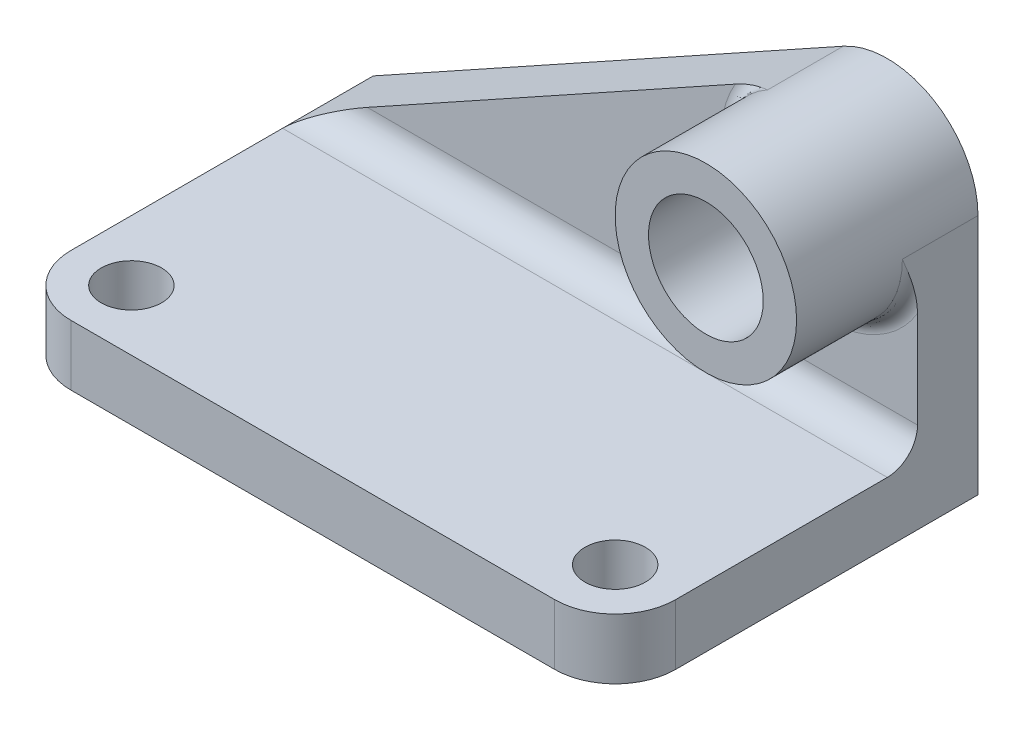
ISO-10303-21;
HEADER;
FILE_DESCRIPTION(('STEP AP214'),'2;1');
FILE_NAME('part.step','',(''),(''),'','','');
FILE_SCHEMA(('AUTOMOTIVE_DESIGN { 1 0 10303 214 1 1 1 1 }'));
ENDSEC;
DATA;
#1=APPLICATION_CONTEXT('core data for automotive mechanical design processes');
#2=APPLICATION_PROTOCOL_DEFINITION('international standard','automotive_design',2000,#1);
#3=PRODUCT_CONTEXT('',#1,'mechanical');
#4=PRODUCT('Part','Part','',(#3));
#5=PRODUCT_RELATED_PRODUCT_CATEGORY('part','',(#4));
#6=PRODUCT_DEFINITION_FORMATION('','',#4);
#7=PRODUCT_DEFINITION_CONTEXT('part definition',#1,'design');
#8=PRODUCT_DEFINITION('design','',#6,#7);
#9=PRODUCT_DEFINITION_SHAPE('','',#8);
#10=(LENGTH_UNIT() NAMED_UNIT(*) SI_UNIT(.MILLI.,.METRE.));
#11=(NAMED_UNIT(*) PLANE_ANGLE_UNIT() SI_UNIT($,.RADIAN.));
#12=(NAMED_UNIT(*) SI_UNIT($,.STERADIAN.) SOLID_ANGLE_UNIT());
#13=UNCERTAINTY_MEASURE_WITH_UNIT(LENGTH_MEASURE(1.E-05),#10,'distance_accuracy_value','');
#14=(GEOMETRIC_REPRESENTATION_CONTEXT(3) GLOBAL_UNCERTAINTY_ASSIGNED_CONTEXT((#13)) GLOBAL_UNIT_ASSIGNED_CONTEXT((#10,
#11,#12)) REPRESENTATION_CONTEXT('',''));
#15=CARTESIAN_POINT('',(0.,0.,0.));
#16=DIRECTION('',(0.,0.,1.));
#17=DIRECTION('',(1.,0.,0.));
#18=AXIS2_PLACEMENT_3D('',#15,#16,#17);
#19=CARTESIAN_POINT('',(-19.05,50.8,12.7));
#20=DIRECTION('',(0.,0.,1.));
#21=DIRECTION('',(1.,0.,0.));
#22=AXIS2_PLACEMENT_3D('',#19,#20,#21);
#23=PLANE('',#22);
#24=DIRECTION('',(0.874457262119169,0.485102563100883,0.));
#25=VECTOR('',#24,1.);
#26=CARTESIAN_POINT('',(-28.2912038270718,67.4584108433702,12.7));
#27=LINE('',#26,#25);
#28=CARTESIAN_POINT('',(-115.553341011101,19.05,12.7));
#29=VERTEX_POINT('',#28);
#30=CARTESIAN_POINT('',(-38.3016629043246,61.9051384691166,12.7));
#31=VERTEX_POINT('',#30);
#32=EDGE_CURVE('E131',#29,#31,#27,.T.);
#33=ORIENTED_EDGE('',*,*,#32,.F.);
#34=DIRECTION('',(-1.,0.,0.));
#35=VECTOR('',#34,1.);
#36=CARTESIAN_POINT('',(-19.05,19.05,12.7));
#37=LINE('',#36,#35);
#38=CARTESIAN_POINT('',(0.,19.05,12.7));
#39=VERTEX_POINT('',#38);
#40=EDGE_CURVE('E226',#29,#39,#37,.F.);
#41=ORIENTED_EDGE('',*,*,#40,.T.);
#42=DIRECTION('',(0.,-1.,0.));
#43=VECTOR('',#42,1.);
#44=CARTESIAN_POINT('',(0.,12.7,12.7));
#45=LINE('',#44,#43);
#46=CARTESIAN_POINT('',(0.,39.3523747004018,12.7));
#47=VERTEX_POINT('',#46);
#48=EDGE_CURVE('E138',#47,#39,#45,.T.);
#49=ORIENTED_EDGE('',*,*,#48,.F.);
#50=CARTESIAN_POINT('',(-19.05,50.8,12.7));
#51=DIRECTION('',(0.,0.,1.));
#52=DIRECTION('',(1.,0.,0.));
#53=AXIS2_PLACEMENT_3D('',#50,#51,#52);
#54=CIRCLE('',#53,22.225);
#55=EDGE_CURVE('E173',#47,#31,#54,.F.);
#56=ORIENTED_EDGE('',*,*,#55,.T.);
#57=EDGE_LOOP('',(#33,#41,#49,#56));
#58=FACE_BOUND('',#57,.T.);
#59=ADVANCED_FACE('F33',(#58),#23,.T.);
#60=CARTESIAN_POINT('',(0.,12.7,0.));
#61=DIRECTION('',(-1.,0.,0.));
#62=DIRECTION('',(0.,0.,1.));
#63=AXIS2_PLACEMENT_3D('',#60,#61,#62);
#64=PLANE('',#63);
#65=DIRECTION('',(0.,0.,-1.));
#66=VECTOR('',#65,1.);
#67=CARTESIAN_POINT('',(0.,12.7,0.));
#68=LINE('',#67,#66);
#69=CARTESIAN_POINT('',(0.,12.7,63.5));
#70=VERTEX_POINT('',#69);
#71=CARTESIAN_POINT('',(0.,12.7,19.05));
#72=VERTEX_POINT('',#71);
#73=EDGE_CURVE('E155',#70,#72,#68,.T.);
#74=ORIENTED_EDGE('',*,*,#73,.F.);
#75=DIRECTION('',(0.,-1.,0.));
#76=VECTOR('',#75,1.);
#77=CARTESIAN_POINT('',(0.,12.7,63.5));
#78=LINE('',#77,#76);
#79=CARTESIAN_POINT('',(0.,0.,63.5));
#80=VERTEX_POINT('',#79);
#81=EDGE_CURVE('E171',#70,#80,#78,.T.);
#82=ORIENTED_EDGE('',*,*,#81,.T.);
#83=DIRECTION('',(0.,0.,-1.));
#84=VECTOR('',#83,1.);
#85=CARTESIAN_POINT('',(0.,0.,0.));
#86=LINE('',#85,#84);
#87=CARTESIAN_POINT('',(0.,0.,0.));
#88=VERTEX_POINT('',#87);
#89=EDGE_CURVE('E114',#80,#88,#86,.T.);
#90=ORIENTED_EDGE('',*,*,#89,.T.);
#91=DIRECTION('',(0.,-1.,0.));
#92=VECTOR('',#91,1.);
#93=CARTESIAN_POINT('',(0.,12.7,0.));
#94=LINE('',#93,#92);
#95=CARTESIAN_POINT('',(0.,50.8,0.));
#96=VERTEX_POINT('',#95);
#97=EDGE_CURVE('E107',#96,#88,#94,.T.);
#98=ORIENTED_EDGE('',*,*,#97,.F.);
#99=DIRECTION('',(0.,0.,-1.));
#100=VECTOR('',#99,1.);
#101=CARTESIAN_POINT('',(0.,50.8,12.7));
#102=LINE('',#101,#100);
#103=CARTESIAN_POINT('',(0.,50.8,15.875));
#104=VERTEX_POINT('',#103);
#105=EDGE_CURVE('E110',#104,#96,#102,.T.);
#106=ORIENTED_EDGE('',*,*,#105,.F.);
#107=CARTESIAN_POINT('',(0.,39.3523747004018,12.7));
#108=CARTESIAN_POINT('',(0.,39.5751778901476,12.7000367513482));
#109=CARTESIAN_POINT('',(0.,39.7979071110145,12.7062199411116));
#110=CARTESIAN_POINT('',(0.,40.242669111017,12.729552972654));
#111=CARTESIAN_POINT('',(0.,40.4647022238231,12.7466963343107));
#112=CARTESIAN_POINT('',(0.,40.907180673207,12.790566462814));
#113=CARTESIAN_POINT('',(0.,41.1276286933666,12.8172668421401));
#114=CARTESIAN_POINT('',(0.,41.5673473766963,12.8791779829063));
#115=CARTESIAN_POINT('',(0.,41.7866178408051,12.9143901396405));
#116=CARTESIAN_POINT('',(0.,42.4381432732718,13.03055146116));
#117=CARTESIAN_POINT('',(0.,42.8684521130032,13.1224961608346));
#118=CARTESIAN_POINT('',(0.,43.7236529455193,13.3296034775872));
#119=CARTESIAN_POINT('',(0.,44.1485403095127,13.4447846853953));
#120=CARTESIAN_POINT('',(0.,45.0991803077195,13.7243947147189));
#121=CARTESIAN_POINT('',(0.,45.6234199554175,13.8939234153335));
#122=CARTESIAN_POINT('',(0.,46.6651114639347,14.2527994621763));
#123=CARTESIAN_POINT('',(0.,47.1825613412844,14.4421524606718));
#124=CARTESIAN_POINT('',(0.,48.729771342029,15.0298892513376));
#125=CARTESIAN_POINT('',(0.,49.7522109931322,15.4472423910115));
#126=CARTESIAN_POINT('',(0.,50.7829622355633,15.8680443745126));
#127=CARTESIAN_POINT('',(0.,50.7914811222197,15.8715221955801));
#128=CARTESIAN_POINT('',(0.,50.8,15.875));
#129=B_SPLINE_CURVE_WITH_KNOTS('',3,(#107,#108,#109,#110,#111,#112,#113,#114,#115,#116,#117,
#118,#119,#120,#121,#122,#123,#124,#125,#126,#127,#128),.UNSPECIFIED.,.F.,.F.,(4,2,2,2,2,2,2,2,
2,2,4),(0.,0.668218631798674,1.33604254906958,2.00203660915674,2.66813991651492,
3.98728120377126,5.30748210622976,6.95977810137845,8.61254648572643,11.9249522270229,
11.9525565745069),.UNSPECIFIED.);
#130=EDGE_CURVE('E218',#104,#47,#129,.F.);
#131=ORIENTED_EDGE('',*,*,#130,.T.);
#132=ORIENTED_EDGE('',*,*,#48,.T.);
#133=CARTESIAN_POINT('',(0.,19.05,19.05));
#134=DIRECTION('',(-1.,0.,0.));
#135=DIRECTION('',(0.,0.,1.));
#136=AXIS2_PLACEMENT_3D('',#133,#134,#135);
#137=CIRCLE('',#136,6.35);
#138=EDGE_CURVE('E11',#39,#72,#137,.T.);
#139=ORIENTED_EDGE('',*,*,#138,.T.);
#140=EDGE_LOOP('',(#74,#82,#90,#98,#106,#131,#132,#139));
#141=FACE_BOUND('',#140,.T.);
#142=ADVANCED_FACE('F35',(#141),#64,.F.);
#143=CARTESIAN_POINT('',(0.,12.7,0.));
#144=DIRECTION('',(0.,0.,1.));
#145=DIRECTION('',(1.,0.,0.));
#146=AXIS2_PLACEMENT_3D('',#143,#144,#145);
#147=PLANE('',#146);
#148=CARTESIAN_POINT('',(-19.05,50.8,0.));
#149=DIRECTION('',(0.,0.,1.));
#150=DIRECTION('',(1.,0.,0.));
#151=AXIS2_PLACEMENT_3D('',#148,#149,#150);
#152=CIRCLE('',#151,12.0489236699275);
#153=CARTESIAN_POINT('',(-7.00107633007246,50.8,0.));
#154=VERTEX_POINT('',#153);
#155=EDGE_CURVE('E406',#154,#154,#152,.T.);
#156=ORIENTED_EDGE('',*,*,#155,.T.);
#157=EDGE_LOOP('',(#156));
#158=FACE_BOUND('',#157,.T.);
#159=DIRECTION('',(-1.,0.,0.));
#160=VECTOR('',#159,1.);
#161=CARTESIAN_POINT('',(0.,0.,0.));
#162=LINE('',#161,#160);
#163=CARTESIAN_POINT('',(-127.,0.,0.));
#164=VERTEX_POINT('',#163);
#165=EDGE_CURVE('E147',#88,#164,#162,.T.);
#166=ORIENTED_EDGE('',*,*,#165,.T.);
#167=DIRECTION('',(0.,-1.,0.));
#168=VECTOR('',#167,1.);
#169=CARTESIAN_POINT('',(-127.,12.7,0.));
#170=LINE('',#169,#168);
#171=CARTESIAN_POINT('',(-127.,12.7,0.));
#172=VERTEX_POINT('',#171);
#173=EDGE_CURVE('E119',#172,#164,#170,.T.);
#174=ORIENTED_EDGE('',*,*,#173,.F.);
#175=DIRECTION('',(0.874457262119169,0.485102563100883,0.));
#176=VECTOR('',#175,1.);
#177=CARTESIAN_POINT('',(-28.2912038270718,67.4584108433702,0.));
#178=LINE('',#177,#176);
#179=CARTESIAN_POINT('',(-28.2912038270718,67.4584108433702,0.));
#180=VERTEX_POINT('',#179);
#181=EDGE_CURVE('E135',#172,#180,#178,.T.);
#182=ORIENTED_EDGE('',*,*,#181,.T.);
#183=CARTESIAN_POINT('',(-19.05,50.8,0.));
#184=DIRECTION('',(0.,0.,-1.));
#185=DIRECTION('',(1.,0.,0.));
#186=AXIS2_PLACEMENT_3D('',#183,#184,#185);
#187=CIRCLE('',#186,19.05);
#188=EDGE_CURVE('E125',#180,#96,#187,.T.);
#189=ORIENTED_EDGE('',*,*,#188,.T.);
#190=ORIENTED_EDGE('',*,*,#97,.T.);
#191=EDGE_LOOP('',(#166,#174,#182,#189,#190));
#192=FACE_BOUND('',#191,.T.);
#193=ADVANCED_FACE('F133',(#158,#192),#147,.F.);
#194=CARTESIAN_POINT('',(-127.,12.7,0.));
#195=DIRECTION('',(1.,0.,0.));
#196=DIRECTION('',(0.,0.,-1.));
#197=AXIS2_PLACEMENT_3D('',#194,#195,#196);
#198=PLANE('',#197);
#199=DIRECTION('',(0.,0.,1.));
#200=VECTOR('',#199,1.);
#201=CARTESIAN_POINT('',(-127.,0.,0.));
#202=LINE('',#201,#200);
#203=CARTESIAN_POINT('',(-127.,0.,63.5));
#204=VERTEX_POINT('',#203);
#205=EDGE_CURVE('E149',#164,#204,#202,.T.);
#206=ORIENTED_EDGE('',*,*,#205,.T.);
#207=DIRECTION('',(0.,-1.,0.));
#208=VECTOR('',#207,1.);
#209=CARTESIAN_POINT('',(-127.,12.7,63.5));
#210=LINE('',#209,#208);
#211=CARTESIAN_POINT('',(-127.,12.7,63.5));
#212=VERTEX_POINT('',#211);
#213=EDGE_CURVE('E165',#204,#212,#210,.F.);
#214=ORIENTED_EDGE('',*,*,#213,.T.);
#215=DIRECTION('',(0.,0.,1.));
#216=VECTOR('',#215,1.);
#217=CARTESIAN_POINT('',(-127.,12.7,0.));
#218=LINE('',#217,#216);
#219=CARTESIAN_POINT('',(-127.,12.7,19.05));
#220=VERTEX_POINT('',#219);
#221=EDGE_CURVE('E164',#220,#212,#218,.T.);
#222=ORIENTED_EDGE('',*,*,#221,.F.);
#223=EDGE_CURVE('E213',#172,#220,#218,.T.);
#224=ORIENTED_EDGE('',*,*,#223,.F.);
#225=ORIENTED_EDGE('',*,*,#173,.T.);
#226=EDGE_LOOP('',(#206,#214,#222,#224,#225));
#227=FACE_BOUND('',#226,.T.);
#228=ADVANCED_FACE('F197',(#227),#198,.F.);
#229=CARTESIAN_POINT('',(0.,12.7,76.2));
#230=DIRECTION('',(0.,0.,-1.));
#231=DIRECTION('',(-1.,0.,0.));
#232=AXIS2_PLACEMENT_3D('',#229,#230,#231);
#233=PLANE('',#232);
#234=DIRECTION('',(1.,0.,0.));
#235=VECTOR('',#234,1.);
#236=CARTESIAN_POINT('',(0.,12.7,76.2));
#237=LINE('',#236,#235);
#238=CARTESIAN_POINT('',(-114.3,12.7,76.2));
#239=VERTEX_POINT('',#238);
#240=CARTESIAN_POINT('',(-12.7,12.7,76.2));
#241=VERTEX_POINT('',#240);
#242=EDGE_CURVE('E207',#239,#241,#237,.T.);
#243=ORIENTED_EDGE('',*,*,#242,.F.);
#244=DIRECTION('',(0.,-1.,0.));
#245=VECTOR('',#244,1.);
#246=CARTESIAN_POINT('',(-114.3,12.7,76.2));
#247=LINE('',#246,#245);
#248=CARTESIAN_POINT('',(-114.3,0.,76.2));
#249=VERTEX_POINT('',#248);
#250=EDGE_CURVE('E184',#239,#249,#247,.T.);
#251=ORIENTED_EDGE('',*,*,#250,.T.);
#252=DIRECTION('',(1.,0.,0.));
#253=VECTOR('',#252,1.);
#254=CARTESIAN_POINT('',(0.,0.,76.2));
#255=LINE('',#254,#253);
#256=CARTESIAN_POINT('',(-12.7,0.,76.2));
#257=VERTEX_POINT('',#256);
#258=EDGE_CURVE('E152',#249,#257,#255,.T.);
#259=ORIENTED_EDGE('',*,*,#258,.T.);
#260=DIRECTION('',(0.,-1.,0.));
#261=VECTOR('',#260,1.);
#262=CARTESIAN_POINT('',(-12.7,12.7,76.2));
#263=LINE('',#262,#261);
#264=EDGE_CURVE('E118',#257,#241,#263,.F.);
#265=ORIENTED_EDGE('',*,*,#264,.T.);
#266=EDGE_LOOP('',(#243,#251,#259,#265));
#267=FACE_BOUND('',#266,.T.);
#268=ADVANCED_FACE('F211',(#267),#233,.F.);
#269=CARTESIAN_POINT('',(0.,12.7,0.));
#270=DIRECTION('',(0.,-1.,0.));
#271=DIRECTION('',(0.,0.,-1.));
#272=AXIS2_PLACEMENT_3D('',#269,#270,#271);
#273=PLANE('',#272);
#274=CARTESIAN_POINT('',(-114.3,12.7,63.5));
#275=DIRECTION('',(0.,1.,0.));
#276=DIRECTION('',(0.,0.,-1.));
#277=AXIS2_PLACEMENT_3D('',#274,#275,#276);
#278=CIRCLE('',#277,6.34999999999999);
#279=CARTESIAN_POINT('',(-114.3,12.7,57.15));
#280=VERTEX_POINT('',#279);
#281=EDGE_CURVE('E411',#280,#280,#278,.T.);
#282=ORIENTED_EDGE('',*,*,#281,.F.);
#283=EDGE_LOOP('',(#282));
#284=FACE_BOUND('',#283,.T.);
#285=CARTESIAN_POINT('',(-12.7,12.7,63.5));
#286=DIRECTION('',(0.,1.,0.));
#287=DIRECTION('',(0.,0.,1.));
#288=AXIS2_PLACEMENT_3D('',#285,#286,#287);
#289=CIRCLE('',#288,6.35);
#290=CARTESIAN_POINT('',(-12.7,12.7,69.85));
#291=VERTEX_POINT('',#290);
#292=EDGE_CURVE('E418',#291,#291,#289,.T.);
#293=ORIENTED_EDGE('',*,*,#292,.F.);
#294=EDGE_LOOP('',(#293));
#295=FACE_BOUND('',#294,.T.);
#296=ORIENTED_EDGE('',*,*,#73,.T.);
#297=DIRECTION('',(-1.,0.,0.));
#298=VECTOR('',#297,1.);
#299=CARTESIAN_POINT('',(0.,12.7,19.05));
#300=LINE('',#299,#298);
#301=EDGE_CURVE('E224',#72,#220,#300,.T.);
#302=ORIENTED_EDGE('',*,*,#301,.T.);
#303=ORIENTED_EDGE('',*,*,#221,.T.);
#304=CARTESIAN_POINT('',(-114.3,12.7,63.5));
#305=DIRECTION('',(0.,-1.,0.));
#306=DIRECTION('',(0.,0.,-1.));
#307=AXIS2_PLACEMENT_3D('',#304,#305,#306);
#308=CIRCLE('',#307,12.7);
#309=EDGE_CURVE('E169',#212,#239,#308,.F.);
#310=ORIENTED_EDGE('',*,*,#309,.T.);
#311=ORIENTED_EDGE('',*,*,#242,.T.);
#312=CARTESIAN_POINT('',(-12.7,12.7,63.5));
#313=DIRECTION('',(0.,-1.,0.));
#314=DIRECTION('',(0.,0.,-1.));
#315=AXIS2_PLACEMENT_3D('',#312,#313,#314);
#316=CIRCLE('',#315,12.7);
#317=EDGE_CURVE('E167',#241,#70,#316,.F.);
#318=ORIENTED_EDGE('',*,*,#317,.T.);
#319=EDGE_LOOP('',(#296,#302,#303,#310,#311,#318));
#320=FACE_BOUND('',#319,.T.);
#321=ADVANCED_FACE('F206',(#284,#295,#320),#273,.F.);
#322=CARTESIAN_POINT('',(0.,0.,0.));
#323=DIRECTION('',(0.,-1.,0.));
#324=DIRECTION('',(0.,0.,-1.));
#325=AXIS2_PLACEMENT_3D('',#322,#323,#324);
#326=PLANE('',#325);
#327=CARTESIAN_POINT('',(-114.3,0.,63.5));
#328=DIRECTION('',(0.,1.,0.));
#329=DIRECTION('',(0.,0.,-1.));
#330=AXIS2_PLACEMENT_3D('',#327,#328,#329);
#331=CIRCLE('',#330,6.34999999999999);
#332=CARTESIAN_POINT('',(-114.3,0.,57.15));
#333=VERTEX_POINT('',#332);
#334=EDGE_CURVE('E416',#333,#333,#331,.T.);
#335=ORIENTED_EDGE('',*,*,#334,.T.);
#336=EDGE_LOOP('',(#335));
#337=FACE_BOUND('',#336,.T.);
#338=CARTESIAN_POINT('',(-12.7,0.,63.5));
#339=DIRECTION('',(0.,1.,0.));
#340=DIRECTION('',(0.,0.,1.));
#341=AXIS2_PLACEMENT_3D('',#338,#339,#340);
#342=CIRCLE('',#341,6.35);
#343=CARTESIAN_POINT('',(-12.7,0.,69.85));
#344=VERTEX_POINT('',#343);
#345=EDGE_CURVE('E141',#344,#344,#342,.T.);
#346=ORIENTED_EDGE('',*,*,#345,.T.);
#347=EDGE_LOOP('',(#346));
#348=FACE_BOUND('',#347,.T.);
#349=ORIENTED_EDGE('',*,*,#258,.F.);
#350=CARTESIAN_POINT('',(-114.3,0.,63.5));
#351=DIRECTION('',(0.,-1.,0.));
#352=DIRECTION('',(0.,0.,-1.));
#353=AXIS2_PLACEMENT_3D('',#350,#351,#352);
#354=CIRCLE('',#353,12.7);
#355=EDGE_CURVE('E188',#249,#204,#354,.T.);
#356=ORIENTED_EDGE('',*,*,#355,.T.);
#357=ORIENTED_EDGE('',*,*,#205,.F.);
#358=ORIENTED_EDGE('',*,*,#165,.F.);
#359=ORIENTED_EDGE('',*,*,#89,.F.);
#360=CARTESIAN_POINT('',(-12.7,0.,63.5));
#361=DIRECTION('',(0.,-1.,0.));
#362=DIRECTION('',(0.,0.,-1.));
#363=AXIS2_PLACEMENT_3D('',#360,#361,#362);
#364=CIRCLE('',#363,12.7);
#365=EDGE_CURVE('E187',#80,#257,#364,.T.);
#366=ORIENTED_EDGE('',*,*,#365,.T.);
#367=EDGE_LOOP('',(#349,#356,#357,#358,#359,#366));
#368=FACE_BOUND('',#367,.T.);
#369=ADVANCED_FACE('F240',(#337,#348,#368),#326,.T.);
#370=CARTESIAN_POINT('',(-19.05,50.8,12.7));
#371=DIRECTION('',(0.,0.,-1.));
#372=DIRECTION('',(-1.,0.,0.));
#373=AXIS2_PLACEMENT_3D('',#370,#371,#372);
#374=CYLINDRICAL_SURFACE('',#373,19.05);
#375=DIRECTION('',(0.,0.,-1.));
#376=VECTOR('',#375,1.);
#377=CARTESIAN_POINT('',(-28.2912038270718,67.4584108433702,12.7));
#378=LINE('',#377,#376);
#379=CARTESIAN_POINT('',(-28.2912038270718,67.4584108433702,15.875));
#380=VERTEX_POINT('',#379);
#381=EDGE_CURVE('E130',#380,#180,#378,.T.);
#382=ORIENTED_EDGE('',*,*,#381,.F.);
#383=CARTESIAN_POINT('',(-19.05,50.8,15.875));
#384=DIRECTION('',(0.,0.,1.));
#385=DIRECTION('',(1.,0.,0.));
#386=AXIS2_PLACEMENT_3D('',#383,#384,#385);
#387=CIRCLE('',#386,19.05);
#388=EDGE_CURVE('E128',#380,#104,#387,.T.);
#389=ORIENTED_EDGE('',*,*,#388,.T.);
#390=ORIENTED_EDGE('',*,*,#105,.T.);
#391=ORIENTED_EDGE('',*,*,#188,.F.);
#392=EDGE_LOOP('',(#382,#389,#390,#391));
#393=FACE_BOUND('',#392,.T.);
#394=CARTESIAN_POINT('',(-19.05,50.8,38.1));
#395=DIRECTION('',(0.,0.,1.));
#396=DIRECTION('',(1.,0.,0.));
#397=AXIS2_PLACEMENT_3D('',#394,#395,#396);
#398=CIRCLE('',#397,19.05);
#399=CARTESIAN_POINT('',(0.,50.8,38.1));
#400=VERTEX_POINT('',#399);
#401=EDGE_CURVE('E136',#400,#400,#398,.T.);
#402=ORIENTED_EDGE('',*,*,#401,.F.);
#403=EDGE_LOOP('',(#402));
#404=FACE_BOUND('',#403,.T.);
#405=ADVANCED_FACE('F123',(#393,#404),#374,.T.);
#406=CARTESIAN_POINT('',(-28.2912038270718,67.4584108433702,12.7));
#407=DIRECTION('',(-0.485102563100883,0.874457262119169,0.));
#408=DIRECTION('',(-0.874457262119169,-0.485102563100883,0.));
#409=AXIS2_PLACEMENT_3D('',#406,#407,#408);
#410=PLANE('',#409);
#411=ORIENTED_EDGE('',*,*,#181,.F.);
#412=ORIENTED_EDGE('',*,*,#223,.T.);
#413=CARTESIAN_POINT('',(-115.553341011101,19.05,19.05));
#414=DIRECTION('',(-0.485102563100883,0.874457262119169,0.));
#415=DIRECTION('',(-0.874457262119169,-0.485102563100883,0.));
#416=AXIS2_PLACEMENT_3D('',#413,#414,#415);
#417=ELLIPSE('',#416,13.0900153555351,6.35);
#418=EDGE_CURVE('E43',#220,#29,#417,.F.);
#419=ORIENTED_EDGE('',*,*,#418,.T.);
#420=ORIENTED_EDGE('',*,*,#32,.T.);
#421=CARTESIAN_POINT('',(-38.3016629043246,61.9051384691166,12.7));
#422=CARTESIAN_POINT('',(-38.1068310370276,62.0132208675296,12.7000367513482));
#423=CARTESIAN_POINT('',(-37.912063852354,62.1212673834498,12.7062199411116));
#424=CARTESIAN_POINT('',(-37.5231384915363,62.3370225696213,12.7295529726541));
#425=CARTESIAN_POINT('',(-37.3289800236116,62.4447314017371,12.7466963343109));
#426=CARTESIAN_POINT('',(-36.942051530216,62.6593788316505,12.7905664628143));
#427=CARTESIAN_POINT('',(-36.7492791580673,62.7663187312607,12.8172668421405));
#428=CARTESIAN_POINT('',(-36.3647639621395,62.9796273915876,12.879177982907));
#429=CARTESIAN_POINT('',(-36.173021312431,63.0859960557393,12.9143901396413));
#430=CARTESIAN_POINT('',(-35.6032901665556,63.402052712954,13.0305514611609));
#431=CARTESIAN_POINT('',(-35.2270034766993,63.6107966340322,13.1224961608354));
#432=CARTESIAN_POINT('',(-34.4791668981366,64.025656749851,13.3296034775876));
#433=CARTESIAN_POINT('',(-34.1076210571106,64.231770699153,13.4447846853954));
#434=CARTESIAN_POINT('',(-33.2763270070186,64.6929285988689,13.7243947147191));
#435=CARTESIAN_POINT('',(-32.8179018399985,64.9472385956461,13.8939234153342));
#436=CARTESIAN_POINT('',(-31.9069871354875,65.4525658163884,14.2527994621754));
#437=CARTESIAN_POINT('',(-31.4544993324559,65.7035820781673,14.4421524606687));
#438=CARTESIAN_POINT('',(-30.1015303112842,66.4541376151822,15.0298892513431));
#439=CARTESIAN_POINT('',(-29.2074505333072,66.9501257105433,15.4472423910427));
#440=CARTESIAN_POINT('',(-28.3061026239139,67.4501457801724,15.8680443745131));
#441=CARTESIAN_POINT('',(-28.2986532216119,67.4542783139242,15.8715221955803));
#442=CARTESIAN_POINT('',(-28.2912038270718,67.4584108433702,15.875));
#443=B_SPLINE_CURVE_WITH_KNOTS('',3,(#421,#422,#423,#424,#425,#426,#427,#428,#429,#430,#431,
#432,#433,#434,#435,#436,#437,#438,#439,#440,#441,#442),.UNSPECIFIED.,.F.,.F.,(4,2,2,2,2,2,2,2,
2,2,4),(0.,0.668218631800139,1.3360425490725,2.00203660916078,2.66813991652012,3.98728120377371,
5.30748210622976,6.95977810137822,8.61254648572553,11.9249522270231,11.9525565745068),.UNSPECIFIED.);
#444=EDGE_CURVE('E264',#31,#380,#443,.T.);
#445=ORIENTED_EDGE('',*,*,#444,.T.);
#446=ORIENTED_EDGE('',*,*,#381,.T.);
#447=EDGE_LOOP('',(#411,#412,#419,#420,#445,#446));
#448=FACE_BOUND('',#447,.T.);
#449=ADVANCED_FACE('F248',(#448),#410,.T.);
#450=CARTESIAN_POINT('',(-114.3,12.7,63.5));
#451=DIRECTION('',(0.,-1.,0.));
#452=DIRECTION('',(0.,0.,-1.));
#453=AXIS2_PLACEMENT_3D('',#450,#451,#452);
#454=CYLINDRICAL_SURFACE('',#453,12.7);
#455=ORIENTED_EDGE('',*,*,#309,.F.);
#456=ORIENTED_EDGE('',*,*,#213,.F.);
#457=ORIENTED_EDGE('',*,*,#355,.F.);
#458=ORIENTED_EDGE('',*,*,#250,.F.);
#459=EDGE_LOOP('',(#455,#456,#457,#458));
#460=FACE_BOUND('',#459,.T.);
#461=ADVANCED_FACE('F202',(#460),#454,.T.);
#462=CARTESIAN_POINT('',(-12.7,12.7,63.5));
#463=DIRECTION('',(0.,-1.,0.));
#464=DIRECTION('',(0.,0.,-1.));
#465=AXIS2_PLACEMENT_3D('',#462,#463,#464);
#466=CYLINDRICAL_SURFACE('',#465,12.7);
#467=ORIENTED_EDGE('',*,*,#317,.F.);
#468=ORIENTED_EDGE('',*,*,#264,.F.);
#469=ORIENTED_EDGE('',*,*,#365,.F.);
#470=ORIENTED_EDGE('',*,*,#81,.F.);
#471=EDGE_LOOP('',(#467,#468,#469,#470));
#472=FACE_BOUND('',#471,.T.);
#473=ADVANCED_FACE('F239',(#472),#466,.T.);
#474=CARTESIAN_POINT('',(-19.05,50.8,38.1));
#475=DIRECTION('',(0.,0.,1.));
#476=DIRECTION('',(1.,0.,0.));
#477=AXIS2_PLACEMENT_3D('',#474,#475,#476);
#478=PLANE('',#477);
#479=CARTESIAN_POINT('',(-19.05,50.8,38.1));
#480=DIRECTION('',(0.,0.,1.));
#481=DIRECTION('',(1.,0.,0.));
#482=AXIS2_PLACEMENT_3D('',#479,#480,#481);
#483=CIRCLE('',#482,12.0489236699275);
#484=CARTESIAN_POINT('',(-7.00107633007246,50.8,38.1));
#485=VERTEX_POINT('',#484);
#486=EDGE_CURVE('E409',#485,#485,#483,.T.);
#487=ORIENTED_EDGE('',*,*,#486,.F.);
#488=EDGE_LOOP('',(#487));
#489=FACE_BOUND('',#488,.T.);
#490=ORIENTED_EDGE('',*,*,#401,.T.);
#491=EDGE_LOOP('',(#490));
#492=FACE_BOUND('',#491,.T.);
#493=ADVANCED_FACE('F274',(#489,#492),#478,.T.);
#494=CARTESIAN_POINT('',(-19.05,50.8,15.875));
#495=DIRECTION('',(0.,0.,1.));
#496=DIRECTION('',(1.,0.,0.));
#497=AXIS2_PLACEMENT_3D('',#494,#495,#496);
#498=TOROIDAL_SURFACE('',#497,22.225,3.175);
#499=ORIENTED_EDGE('',*,*,#130,.F.);
#500=ORIENTED_EDGE('',*,*,#388,.F.);
#501=ORIENTED_EDGE('',*,*,#444,.F.);
#502=ORIENTED_EDGE('',*,*,#55,.F.);
#503=EDGE_LOOP('',(#499,#500,#501,#502));
#504=FACE_BOUND('',#503,.T.);
#505=ADVANCED_FACE('F269',(#504),#498,.F.);
#506=CARTESIAN_POINT('',(0.,19.05,19.05));
#507=DIRECTION('',(-1.,0.,0.));
#508=DIRECTION('',(0.,0.,1.));
#509=AXIS2_PLACEMENT_3D('',#506,#507,#508);
#510=CYLINDRICAL_SURFACE('',#509,6.35);
#511=ORIENTED_EDGE('',*,*,#138,.F.);
#512=ORIENTED_EDGE('',*,*,#40,.F.);
#513=ORIENTED_EDGE('',*,*,#418,.F.);
#514=ORIENTED_EDGE('',*,*,#301,.F.);
#515=EDGE_LOOP('',(#511,#512,#513,#514));
#516=FACE_BOUND('',#515,.T.);
#517=ADVANCED_FACE('F236',(#516),#510,.F.);
#518=CARTESIAN_POINT('',(-12.7,0.,63.5));
#519=DIRECTION('',(0.,1.,0.));
#520=DIRECTION('',(0.,0.,1.));
#521=AXIS2_PLACEMENT_3D('',#518,#519,#520);
#522=CYLINDRICAL_SURFACE('',#521,6.35);
#523=ORIENTED_EDGE('',*,*,#345,.F.);
#524=EDGE_LOOP('',(#523));
#525=FACE_BOUND('',#524,.T.);
#526=ORIENTED_EDGE('',*,*,#292,.T.);
#527=EDGE_LOOP('',(#526));
#528=FACE_BOUND('',#527,.T.);
#529=ADVANCED_FACE('F361',(#525,#528),#522,.F.);
#530=CARTESIAN_POINT('',(-114.3,0.,63.5));
#531=DIRECTION('',(0.,1.,0.));
#532=DIRECTION('',(0.,0.,1.));
#533=AXIS2_PLACEMENT_3D('',#530,#531,#532);
#534=CYLINDRICAL_SURFACE('',#533,6.34999999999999);
#535=ORIENTED_EDGE('',*,*,#334,.F.);
#536=EDGE_LOOP('',(#535));
#537=FACE_BOUND('',#536,.T.);
#538=ORIENTED_EDGE('',*,*,#281,.T.);
#539=EDGE_LOOP('',(#538));
#540=FACE_BOUND('',#539,.T.);
#541=ADVANCED_FACE('F369',(#537,#540),#534,.F.);
#542=CARTESIAN_POINT('',(-19.05,50.8,0.));
#543=DIRECTION('',(0.,0.,1.));
#544=DIRECTION('',(1.,0.,0.));
#545=AXIS2_PLACEMENT_3D('',#542,#543,#544);
#546=CYLINDRICAL_SURFACE('',#545,12.0489236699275);
#547=ORIENTED_EDGE('',*,*,#155,.F.);
#548=EDGE_LOOP('',(#547));
#549=FACE_BOUND('',#548,.T.);
#550=ORIENTED_EDGE('',*,*,#486,.T.);
#551=EDGE_LOOP('',(#550));
#552=FACE_BOUND('',#551,.T.);
#553=ADVANCED_FACE('F378',(#549,#552),#546,.F.);
#554=CLOSED_SHELL('',(#59,#142,#193,#228,#268,#321,#369,#405,#449,#461,#473,#493,#505,#517,#529,
#541,#553));
#555=MANIFOLD_SOLID_BREP('B2',#554);
#556=ADVANCED_BREP_SHAPE_REPRESENTATION('',(#18,#555),#14);
#557=SHAPE_DEFINITION_REPRESENTATION(#9,#556);
ENDSEC;
END-ISO-10303-21;
